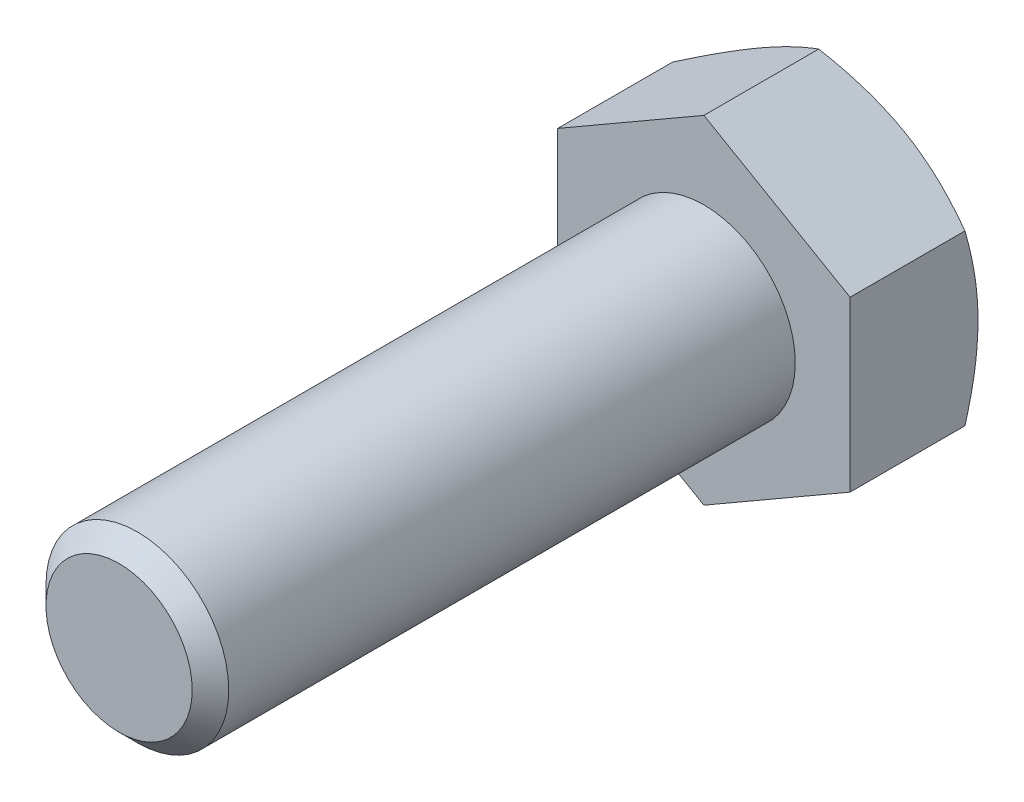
ISO-10303-21;
HEADER;
FILE_DESCRIPTION(('STEP AP214'),'2;1');
FILE_NAME('part.step','',(''),(''),'','','');
FILE_SCHEMA(('AUTOMOTIVE_DESIGN { 1 0 10303 214 1 1 1 1 }'));
ENDSEC;
DATA;
#1=APPLICATION_CONTEXT('core data for automotive mechanical design processes');
#2=APPLICATION_PROTOCOL_DEFINITION('international standard','automotive_design',2000,#1);
#3=PRODUCT_CONTEXT('',#1,'mechanical');
#4=PRODUCT('Part','Part','',(#3));
#5=PRODUCT_RELATED_PRODUCT_CATEGORY('part','',(#4));
#6=PRODUCT_DEFINITION_FORMATION('','',#4);
#7=PRODUCT_DEFINITION_CONTEXT('part definition',#1,'design');
#8=PRODUCT_DEFINITION('design','',#6,#7);
#9=PRODUCT_DEFINITION_SHAPE('','',#8);
#10=(LENGTH_UNIT() NAMED_UNIT(*) SI_UNIT(.MILLI.,.METRE.));
#11=(NAMED_UNIT(*) PLANE_ANGLE_UNIT() SI_UNIT($,.RADIAN.));
#12=(NAMED_UNIT(*) SI_UNIT($,.STERADIAN.) SOLID_ANGLE_UNIT());
#13=UNCERTAINTY_MEASURE_WITH_UNIT(LENGTH_MEASURE(1.E-05),#10,'distance_accuracy_value','');
#14=(GEOMETRIC_REPRESENTATION_CONTEXT(3) GLOBAL_UNCERTAINTY_ASSIGNED_CONTEXT((#13)) GLOBAL_UNIT_ASSIGNED_CONTEXT((#10,
#11,#12)) REPRESENTATION_CONTEXT('',''));
#15=CARTESIAN_POINT('',(0.,0.,0.));
#16=DIRECTION('',(0.,0.,1.));
#17=DIRECTION('',(1.,0.,0.));
#18=AXIS2_PLACEMENT_3D('',#15,#16,#17);
#19=CARTESIAN_POINT('',(0.,0.,16.));
#20=DIRECTION('',(0.,0.,1.));
#21=DIRECTION('',(1.,0.,0.));
#22=AXIS2_PLACEMENT_3D('',#19,#20,#21);
#23=PLANE('',#22);
#24=CARTESIAN_POINT('',(0.,0.,16.));
#25=DIRECTION('',(0.,0.,1.));
#26=DIRECTION('',(1.,0.,0.));
#27=AXIS2_PLACEMENT_3D('',#24,#25,#26);
#28=CIRCLE('',#27,2.);
#29=CARTESIAN_POINT('',(2.,0.,16.));
#30=VERTEX_POINT('',#29);
#31=EDGE_CURVE('E205',#30,#30,#28,.T.);
#32=ORIENTED_EDGE('',*,*,#31,.T.);
#33=EDGE_LOOP('',(#32));
#34=FACE_BOUND('',#33,.T.);
#35=ADVANCED_FACE('F31',(#34),#23,.T.);
#36=CARTESIAN_POINT('',(0.,0.,0.));
#37=DIRECTION('',(0.,0.,1.));
#38=DIRECTION('',(1.,0.,0.));
#39=AXIS2_PLACEMENT_3D('',#36,#37,#38);
#40=CYLINDRICAL_SURFACE('',#39,2.5);
#41=CARTESIAN_POINT('',(0.,0.,15.5));
#42=DIRECTION('',(0.,0.,1.));
#43=DIRECTION('',(1.,0.,0.));
#44=AXIS2_PLACEMENT_3D('',#41,#42,#43);
#45=CIRCLE('',#44,2.5);
#46=CARTESIAN_POINT('',(2.5,0.,15.5));
#47=VERTEX_POINT('',#46);
#48=EDGE_CURVE('E207',#47,#47,#45,.F.);
#49=ORIENTED_EDGE('',*,*,#48,.T.);
#50=EDGE_LOOP('',(#49));
#51=FACE_BOUND('',#50,.T.);
#52=CARTESIAN_POINT('',(0.,0.,0.));
#53=DIRECTION('',(0.,0.,1.));
#54=DIRECTION('',(1.,0.,0.));
#55=AXIS2_PLACEMENT_3D('',#52,#53,#54);
#56=CIRCLE('',#55,2.5);
#57=CARTESIAN_POINT('',(2.5,0.,0.));
#58=VERTEX_POINT('',#57);
#59=EDGE_CURVE('E208',#58,#58,#56,.F.);
#60=ORIENTED_EDGE('',*,*,#59,.F.);
#61=EDGE_LOOP('',(#60));
#62=FACE_BOUND('',#61,.T.);
#63=ADVANCED_FACE('F196',(#51,#62),#40,.T.);
#64=CARTESIAN_POINT('',(0.,0.,16.));
#65=DIRECTION('',(0.,0.,-1.));
#66=DIRECTION('',(-1.,0.,0.));
#67=AXIS2_PLACEMENT_3D('',#64,#65,#66);
#68=CONICAL_SURFACE('',#67,2.,0.785398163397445);
#69=ORIENTED_EDGE('',*,*,#48,.F.);
#70=EDGE_LOOP('',(#69));
#71=FACE_BOUND('',#70,.T.);
#72=ORIENTED_EDGE('',*,*,#31,.F.);
#73=EDGE_LOOP('',(#72));
#74=FACE_BOUND('',#73,.T.);
#75=ADVANCED_FACE('F201',(#71,#74),#68,.T.);
#76=CARTESIAN_POINT('',(0.,4.61880215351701,-3.5));
#77=DIRECTION('',(0.499999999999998,0.86602540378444,0.));
#78=DIRECTION('',(-0.86602540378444,0.499999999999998,0.));
#79=AXIS2_PLACEMENT_3D('',#76,#77,#78);
#80=PLANE('',#79);
#81=CARTESIAN_POINT('',(-0.000200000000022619,4.61891762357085,-3.14266774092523));
#82=CARTESIAN_POINT('',(0.175579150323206,4.51743148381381,-3.20128212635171));
#83=CARTESIAN_POINT('',(0.352875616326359,4.41506932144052,-3.25458967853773));
#84=CARTESIAN_POINT('',(0.710538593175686,4.2085725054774,-3.34763832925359));
#85=CARTESIAN_POINT('',(0.890911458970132,4.10443418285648,-3.38734651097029));
#86=CARTESIAN_POINT('',(1.24942181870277,3.89744813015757,-3.44915778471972));
#87=CARTESIAN_POINT('',(1.42750415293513,3.7946322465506,-3.47167226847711));
#88=CARTESIAN_POINT('',(1.78450671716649,3.58851671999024,-3.49854937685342));
#89=CARTESIAN_POINT('',(1.96342564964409,3.48521782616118,-3.50293425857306));
#90=CARTESIAN_POINT('',(2.29774284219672,3.2921997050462,-3.49380992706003));
#91=CARTESIAN_POINT('',(2.45319115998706,3.20245157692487,-3.48254104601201));
#92=CARTESIAN_POINT('',(2.76307505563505,3.02354002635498,-3.44682600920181));
#93=CARTESIAN_POINT('',(2.91750956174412,2.93437722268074,-3.42236765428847));
#94=CARTESIAN_POINT('',(3.22803232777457,2.75509682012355,-3.36122393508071));
#95=CARTESIAN_POINT('',(3.3840812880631,2.66500191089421,-3.32427939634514));
#96=CARTESIAN_POINT('',(3.69385183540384,2.48615580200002,-3.24042992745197));
#97=CARTESIAN_POINT('',(3.84757739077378,2.39740231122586,-3.19354469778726));
#98=CARTESIAN_POINT('',(4.0002,2.30928560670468,-3.14266774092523));
#99=B_SPLINE_CURVE_WITH_KNOTS('',3,(#81,#82,#83,#84,#85,#86,#87,#88,#89,#90,#91,#92,#93,#94,#95,
#96,#97,#98),.UNSPECIFIED.,.F.,.F.,(4,2,2,2,2,2,2,2,4),(0.,0.634047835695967,1.26961969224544,
1.88946157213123,2.50854226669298,3.04757825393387,3.58711366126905,4.13861653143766,
4.68903648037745),.UNSPECIFIED.);
#100=CARTESIAN_POINT('',(0.,4.61880215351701,-3.14273441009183));
#101=VERTEX_POINT('',#100);
#102=CARTESIAN_POINT('',(1.99999999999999,3.46410161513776,-3.5));
#103=VERTEX_POINT('',#102);
#104=EDGE_CURVE('E241',#101,#103,#99,.T.);
#105=ORIENTED_EDGE('',*,*,#104,.F.);
#106=DIRECTION('',(0.,0.,1.));
#107=VECTOR('',#106,1.);
#108=CARTESIAN_POINT('',(0.,4.61880215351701,-3.5));
#109=LINE('',#108,#107);
#110=CARTESIAN_POINT('',(0.,4.61880215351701,0.));
#111=VERTEX_POINT('',#110);
#112=EDGE_CURVE('E215',#101,#111,#109,.T.);
#113=ORIENTED_EDGE('',*,*,#112,.T.);
#114=DIRECTION('',(-0.86602540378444,0.499999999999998,0.));
#115=VECTOR('',#114,1.);
#116=CARTESIAN_POINT('',(0.,4.61880215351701,0.));
#117=LINE('',#116,#115);
#118=CARTESIAN_POINT('',(4.,2.30940107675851,0.));
#119=VERTEX_POINT('',#118);
#120=EDGE_CURVE('E239',#119,#111,#117,.T.);
#121=ORIENTED_EDGE('',*,*,#120,.F.);
#122=DIRECTION('',(0.,0.,1.));
#123=VECTOR('',#122,1.);
#124=CARTESIAN_POINT('',(4.,2.30940107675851,-3.5));
#125=LINE('',#124,#123);
#126=CARTESIAN_POINT('',(4.,2.30940107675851,-3.14273441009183));
#127=VERTEX_POINT('',#126);
#128=EDGE_CURVE('E212',#127,#119,#125,.T.);
#129=ORIENTED_EDGE('',*,*,#128,.F.);
#130=EDGE_CURVE('E171',#103,#127,#99,.T.);
#131=ORIENTED_EDGE('',*,*,#130,.F.);
#132=EDGE_LOOP('',(#105,#113,#121,#129,#131));
#133=FACE_BOUND('',#132,.T.);
#134=ADVANCED_FACE('F181',(#133),#80,.T.);
#135=CARTESIAN_POINT('',(4.,-2.30940107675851,-3.5));
#136=DIRECTION('',(1.,0.,0.));
#137=DIRECTION('',(0.,0.,-1.));
#138=AXIS2_PLACEMENT_3D('',#135,#136,#137);
#139=PLANE('',#138);
#140=CARTESIAN_POINT('',(4.,-6.32016209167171,-1.49105074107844));
#141=CARTESIAN_POINT('',(4.,-6.14442149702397,-1.57676392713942));
#142=CARTESIAN_POINT('',(4.,-5.96828976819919,-1.66168830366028));
#143=CARTESIAN_POINT('',(4.,-5.61503642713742,-1.82951794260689));
#144=CARTESIAN_POINT('',(4.,-5.43791467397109,-1.91242290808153));
#145=CARTESIAN_POINT('',(4.,-5.08161610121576,-2.07616457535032));
#146=CARTESIAN_POINT('',(4.,-4.90243340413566,-2.15698853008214));
#147=CARTESIAN_POINT('',(4.,-4.54268290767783,-2.31548071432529));
#148=CARTESIAN_POINT('',(4.,-4.36211517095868,-2.3931490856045));
#149=CARTESIAN_POINT('',(4.,-3.99309046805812,-2.54709429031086));
#150=CARTESIAN_POINT('',(4.,-3.80457523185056,-2.62323217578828));
#151=CARTESIAN_POINT('',(4.,-3.42538286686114,-2.77002330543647));
#152=CARTESIAN_POINT('',(4.,-3.23470550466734,-2.84067595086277));
#153=CARTESIAN_POINT('',(4.,-2.85120603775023,-2.9747272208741));
#154=CARTESIAN_POINT('',(4.,-2.65838877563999,-3.03813956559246));
#155=CARTESIAN_POINT('',(4.,-2.26999073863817,-3.15575322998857));
#156=CARTESIAN_POINT('',(4.,-2.07441081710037,-3.2099573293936));
#157=CARTESIAN_POINT('',(4.,-1.6814638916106,-3.30634238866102));
#158=CARTESIAN_POINT('',(4.,-1.48411388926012,-3.34859141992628));
#159=CARTESIAN_POINT('',(4.,-1.08684206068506,-3.41875684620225));
#160=CARTESIAN_POINT('',(4.,-0.886920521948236,-3.44667482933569));
#161=CARTESIAN_POINT('',(4.,-0.488161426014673,-3.48559194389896));
#162=CARTESIAN_POINT('',(4.,-0.289346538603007,-3.49681761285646));
#163=CARTESIAN_POINT('',(4.,0.108530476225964,-3.5020027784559));
#164=CARTESIAN_POINT('',(4.,0.307592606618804,-3.49596206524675));
#165=CARTESIAN_POINT('',(4.,0.642130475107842,-3.47173841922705));
#166=CARTESIAN_POINT('',(4.,0.777947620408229,-3.45796321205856));
#167=CARTESIAN_POINT('',(4.,1.04865722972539,-3.42317125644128));
#168=CARTESIAN_POINT('',(4.,1.18354957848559,-3.4021536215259));
#169=CARTESIAN_POINT('',(4.,1.58661718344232,-3.32933470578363));
#170=CARTESIAN_POINT('',(4.,1.85305348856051,-3.2677780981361));
#171=CARTESIAN_POINT('',(4.,2.2516931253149,-3.16013293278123));
#172=CARTESIAN_POINT('',(4.,2.38593642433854,-3.12116080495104));
#173=CARTESIAN_POINT('',(4.,2.65312122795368,-3.03894486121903));
#174=CARTESIAN_POINT('',(4.,2.78606272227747,-2.99570101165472));
#175=CARTESIAN_POINT('',(4.,3.05068341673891,-2.90565399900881));
#176=CARTESIAN_POINT('',(4.,3.18236294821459,-2.8588518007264));
#177=CARTESIAN_POINT('',(4.,3.44461473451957,-2.76226098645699));
#178=CARTESIAN_POINT('',(4.,3.57518701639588,-2.71247244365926));
#179=CARTESIAN_POINT('',(4.,3.93177798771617,-2.57257226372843));
#180=CARTESIAN_POINT('',(4.,4.15680215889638,-2.47992787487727));
#181=CARTESIAN_POINT('',(4.,4.60447894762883,-2.28905562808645));
#182=CARTESIAN_POINT('',(4.,4.82713127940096,-2.19082710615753));
#183=CARTESIAN_POINT('',(4.,5.27061186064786,-1.99013448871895));
#184=CARTESIAN_POINT('',(4.,5.49143940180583,-1.88766883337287));
#185=CARTESIAN_POINT('',(4.,5.93157734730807,-1.67952247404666));
#186=CARTESIAN_POINT('',(4.,6.15088770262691,-1.57384166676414));
#187=CARTESIAN_POINT('',(4.,6.58864452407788,-1.35980684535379));
#188=CARTESIAN_POINT('',(4.,6.80708897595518,-1.25144872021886));
#189=CARTESIAN_POINT('',(4.,7.24298360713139,-1.0327486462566));
#190=CARTESIAN_POINT('',(4.,7.4604337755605,-0.922406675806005));
#191=CARTESIAN_POINT('',(4.,8.11147090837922,-0.589073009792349));
#192=CARTESIAN_POINT('',(4.,8.54384921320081,-0.363721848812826));
#193=CARTESIAN_POINT('',(4.,9.35956992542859,0.0664624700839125));
#194=CARTESIAN_POINT('',(4.,9.74313951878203,0.270866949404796));
#195=CARTESIAN_POINT('',(4.,10.5090013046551,0.682114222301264));
#196=CARTESIAN_POINT('',(4.,10.891293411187,0.888957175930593));
#197=CARTESIAN_POINT('',(4.,11.6535663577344,1.30371780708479));
#198=CARTESIAN_POINT('',(4.,12.0335506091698,1.51162922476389));
#199=CARTESIAN_POINT('',(4.,12.7927224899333,1.928827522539));
#200=CARTESIAN_POINT('',(4.,13.1719101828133,2.13811428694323));
#201=CARTESIAN_POINT('',(4.,13.5508195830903,2.34790058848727));
#202=B_SPLINE_CURVE_WITH_KNOTS('',3,(#140,#141,#142,#143,#144,#145,#146,#147,#148,#149,#150,
#151,#152,#153,#154,#155,#156,#157,#158,#159,#160,#161,#162,#163,#164,#165,#166,#167,#168,#169,
#170,#171,#172,#173,#174,#175,#176,#177,#178,#179,#180,#181,#182,#183,#184,#185,#186,#187,#188,
#189,#190,#191,#192,#193,#194,#195,#196,#197,#198,#199,#200,#201),.UNSPECIFIED.,.F.,.F.,(4,2,2,
2,2,2,2,2,2,2,2,2,2,2,2,2,2,2,2,2,2,2,2,2,2,2,2,2,2,2,4),(0.,0.586592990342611,1.17327172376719,
1.76295108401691,2.35260392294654,2.96246799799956,3.57239854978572,4.18115341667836,
4.78972418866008,5.39475667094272,5.99972209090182,6.59639988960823,7.19308494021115,
7.60243041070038,8.01182600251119,8.83100524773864,9.25032401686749,9.66964609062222,
10.0888548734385,10.5080533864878,11.2379871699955,11.9680079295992,12.6982998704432,
13.4286153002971,14.1601319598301,14.8916565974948,16.354355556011,17.6582490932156,
18.9622286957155,20.261662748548,21.5609888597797),.UNSPECIFIED.);
#203=CARTESIAN_POINT('',(4.,0.,-3.5));
#204=VERTEX_POINT('',#203);
#205=EDGE_CURVE('E169',#127,#204,#202,.F.);
#206=ORIENTED_EDGE('',*,*,#205,.F.);
#207=ORIENTED_EDGE('',*,*,#128,.T.);
#208=DIRECTION('',(0.,1.,0.));
#209=VECTOR('',#208,1.);
#210=CARTESIAN_POINT('',(4.,-2.30940107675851,0.));
#211=LINE('',#210,#209);
#212=CARTESIAN_POINT('',(4.,-2.30940107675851,0.));
#213=VERTEX_POINT('',#212);
#214=EDGE_CURVE('E217',#213,#119,#211,.T.);
#215=ORIENTED_EDGE('',*,*,#214,.F.);
#216=DIRECTION('',(0.,0.,1.));
#217=VECTOR('',#216,1.);
#218=CARTESIAN_POINT('',(4.,-2.30940107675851,-3.5));
#219=LINE('',#218,#217);
#220=CARTESIAN_POINT('',(4.,-2.30940107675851,-3.14273441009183));
#221=VERTEX_POINT('',#220);
#222=EDGE_CURVE('E223',#221,#213,#219,.T.);
#223=ORIENTED_EDGE('',*,*,#222,.F.);
#224=EDGE_CURVE('E164',#204,#221,#202,.F.);
#225=ORIENTED_EDGE('',*,*,#224,.F.);
#226=EDGE_LOOP('',(#206,#207,#215,#223,#225));
#227=FACE_BOUND('',#226,.T.);
#228=ADVANCED_FACE('F177',(#227),#139,.T.);
#229=CARTESIAN_POINT('',(0.,-4.61880215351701,-3.5));
#230=DIRECTION('',(0.499999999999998,-0.86602540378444,0.));
#231=DIRECTION('',(0.86602540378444,0.499999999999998,0.));
#232=AXIS2_PLACEMENT_3D('',#229,#230,#231);
#233=PLANE('',#232);
#234=CARTESIAN_POINT('',(4.0002,-2.30928560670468,-3.14266774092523));
#235=CARTESIAN_POINT('',(3.82442084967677,-2.41077174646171,-3.20128212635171));
#236=CARTESIAN_POINT('',(3.64712438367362,-2.513133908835,-3.25458967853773));
#237=CARTESIAN_POINT('',(3.28946140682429,-2.71963072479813,-3.3476383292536));
#238=CARTESIAN_POINT('',(3.10908854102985,-2.82376904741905,-3.3873465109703));
#239=CARTESIAN_POINT('',(2.75057818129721,-3.03075510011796,-3.44915778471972));
#240=CARTESIAN_POINT('',(2.57249584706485,-3.13357098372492,-3.47167226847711));
#241=CARTESIAN_POINT('',(2.21549328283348,-3.33968651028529,-3.49854937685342));
#242=CARTESIAN_POINT('',(2.03657435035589,-3.44298540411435,-3.50293425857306));
#243=CARTESIAN_POINT('',(1.70225715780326,-3.63600352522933,-3.49380992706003));
#244=CARTESIAN_POINT('',(1.54680884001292,-3.72575165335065,-3.48254104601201));
#245=CARTESIAN_POINT('',(1.23692494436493,-3.90466320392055,-3.44682600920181));
#246=CARTESIAN_POINT('',(1.08249043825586,-3.99382600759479,-3.42236765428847));
#247=CARTESIAN_POINT('',(0.771967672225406,-4.17310641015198,-3.36122393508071));
#248=CARTESIAN_POINT('',(0.61591871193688,-4.26320131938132,-3.32427939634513));
#249=CARTESIAN_POINT('',(0.306148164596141,-4.44204742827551,-3.24042992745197));
#250=CARTESIAN_POINT('',(0.1524226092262,-4.53080091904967,-3.19354469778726));
#251=CARTESIAN_POINT('',(-0.000200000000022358,-4.61891762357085,-3.14266774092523));
#252=B_SPLINE_CURVE_WITH_KNOTS('',3,(#234,#235,#236,#237,#238,#239,#240,#241,#242,#243,#244,
#245,#246,#247,#248,#249,#250,#251),.UNSPECIFIED.,.F.,.F.,(4,2,2,2,2,2,2,2,4),(0.,
0.634047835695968,1.26961969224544,1.88946157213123,2.50854226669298,3.04757825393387,
3.58711366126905,4.13861653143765,4.68903648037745),.UNSPECIFIED.);
#253=CARTESIAN_POINT('',(1.99999999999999,-3.46410161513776,-3.5));
#254=VERTEX_POINT('',#253);
#255=EDGE_CURVE('E170',#221,#254,#252,.T.);
#256=ORIENTED_EDGE('',*,*,#255,.F.);
#257=ORIENTED_EDGE('',*,*,#222,.T.);
#258=DIRECTION('',(0.86602540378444,0.499999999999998,0.));
#259=VECTOR('',#258,1.);
#260=CARTESIAN_POINT('',(0.,-4.61880215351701,0.));
#261=LINE('',#260,#259);
#262=CARTESIAN_POINT('',(0.,-4.61880215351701,0.));
#263=VERTEX_POINT('',#262);
#264=EDGE_CURVE('E228',#263,#213,#261,.T.);
#265=ORIENTED_EDGE('',*,*,#264,.F.);
#266=DIRECTION('',(0.,0.,1.));
#267=VECTOR('',#266,1.);
#268=CARTESIAN_POINT('',(0.,-4.61880215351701,-3.5));
#269=LINE('',#268,#267);
#270=CARTESIAN_POINT('',(0.,-4.61880215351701,-3.14273441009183));
#271=VERTEX_POINT('',#270);
#272=EDGE_CURVE('E221',#271,#263,#269,.T.);
#273=ORIENTED_EDGE('',*,*,#272,.F.);
#274=EDGE_CURVE('E158',#254,#271,#252,.T.);
#275=ORIENTED_EDGE('',*,*,#274,.F.);
#276=EDGE_LOOP('',(#256,#257,#265,#273,#275));
#277=FACE_BOUND('',#276,.T.);
#278=ADVANCED_FACE('F180',(#277),#233,.T.);
#279=CARTESIAN_POINT('',(0.,-4.61880215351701,-3.5));
#280=DIRECTION('',(-0.500000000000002,-0.866025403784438,0.));
#281=DIRECTION('',(0.866025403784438,-0.500000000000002,0.));
#282=AXIS2_PLACEMENT_3D('',#279,#280,#281);
#283=PLANE('',#282);
#284=CARTESIAN_POINT('',(0.000199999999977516,-4.61891762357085,-3.14266774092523));
#285=CARTESIAN_POINT('',(-0.17557915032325,-4.51743148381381,-3.20128212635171));
#286=CARTESIAN_POINT('',(-0.352875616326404,-4.41506932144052,-3.25458967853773));
#287=CARTESIAN_POINT('',(-0.710538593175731,-4.2085725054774,-3.34763832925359));
#288=CARTESIAN_POINT('',(-0.890911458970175,-4.10443418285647,-3.38734651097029));
#289=CARTESIAN_POINT('',(-1.24942181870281,-3.89744813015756,-3.44915778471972));
#290=CARTESIAN_POINT('',(-1.42750415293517,-3.7946322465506,-3.47167226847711));
#291=CARTESIAN_POINT('',(-1.78450671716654,-3.58851671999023,-3.49854937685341));
#292=CARTESIAN_POINT('',(-1.96342564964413,-3.48521782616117,-3.50293425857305));
#293=CARTESIAN_POINT('',(-2.29774284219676,-3.29219970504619,-3.49380992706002));
#294=CARTESIAN_POINT('',(-2.45319115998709,-3.20245157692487,-3.482541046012));
#295=CARTESIAN_POINT('',(-2.76307505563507,-3.02354002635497,-3.4468260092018));
#296=CARTESIAN_POINT('',(-2.91750956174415,-2.93437722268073,-3.42236765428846));
#297=CARTESIAN_POINT('',(-3.22803232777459,-2.75509682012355,-3.3612239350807));
#298=CARTESIAN_POINT('',(-3.38408128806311,-2.66500191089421,-3.32427939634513));
#299=CARTESIAN_POINT('',(-3.69385183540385,-2.48615580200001,-3.24042992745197));
#300=CARTESIAN_POINT('',(-3.84757739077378,-2.39740231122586,-3.19354469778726));
#301=CARTESIAN_POINT('',(-4.0002,-2.30928560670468,-3.14266774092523));
#302=B_SPLINE_CURVE_WITH_KNOTS('',3,(#284,#285,#286,#287,#288,#289,#290,#291,#292,#293,#294,
#295,#296,#297,#298,#299,#300,#301),.UNSPECIFIED.,.F.,.F.,(4,2,2,2,2,2,2,2,4),(0.,
0.634047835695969,1.26961969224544,1.88946157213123,2.50854226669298,3.04757825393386,
3.58711366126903,4.13861653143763,4.68903648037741),.UNSPECIFIED.);
#303=CARTESIAN_POINT('',(-2.00000000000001,-3.46410161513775,-3.5));
#304=VERTEX_POINT('',#303);
#305=EDGE_CURVE('E260',#271,#304,#302,.T.);
#306=ORIENTED_EDGE('',*,*,#305,.F.);
#307=ORIENTED_EDGE('',*,*,#272,.T.);
#308=DIRECTION('',(0.866025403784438,-0.500000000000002,0.));
#309=VECTOR('',#308,1.);
#310=CARTESIAN_POINT('',(0.,-4.61880215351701,0.));
#311=LINE('',#310,#309);
#312=CARTESIAN_POINT('',(-4.,-2.30940107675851,0.));
#313=VERTEX_POINT('',#312);
#314=EDGE_CURVE('E231',#313,#263,#311,.T.);
#315=ORIENTED_EDGE('',*,*,#314,.F.);
#316=DIRECTION('',(0.,0.,1.));
#317=VECTOR('',#316,1.);
#318=CARTESIAN_POINT('',(-4.,-2.30940107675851,-3.5));
#319=LINE('',#318,#317);
#320=CARTESIAN_POINT('',(-4.,-2.30940107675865,-3.14273441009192));
#321=VERTEX_POINT('',#320);
#322=EDGE_CURVE('E219',#321,#313,#319,.T.);
#323=ORIENTED_EDGE('',*,*,#322,.F.);
#324=EDGE_CURVE('E107',#304,#321,#302,.T.);
#325=ORIENTED_EDGE('',*,*,#324,.F.);
#326=EDGE_LOOP('',(#306,#307,#315,#323,#325));
#327=FACE_BOUND('',#326,.T.);
#328=ADVANCED_FACE('F185',(#327),#283,.T.);
#329=CARTESIAN_POINT('',(-4.,-2.30940107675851,-3.5));
#330=DIRECTION('',(-1.,0.,0.));
#331=DIRECTION('',(0.,0.,1.));
#332=AXIS2_PLACEMENT_3D('',#329,#330,#331);
#333=PLANE('',#332);
#334=CARTESIAN_POINT('',(-4.,-6.3201620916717,-1.49105074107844));
#335=CARTESIAN_POINT('',(-4.,-6.14442149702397,-1.57676392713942));
#336=CARTESIAN_POINT('',(-4.,-5.96828976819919,-1.66168830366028));
#337=CARTESIAN_POINT('',(-4.,-5.61503642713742,-1.82951794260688));
#338=CARTESIAN_POINT('',(-4.,-5.43791467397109,-1.91242290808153));
#339=CARTESIAN_POINT('',(-4.,-5.08161610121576,-2.07616457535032));
#340=CARTESIAN_POINT('',(-4.,-4.90243340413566,-2.15698853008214));
#341=CARTESIAN_POINT('',(-4.,-4.54268290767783,-2.31548071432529));
#342=CARTESIAN_POINT('',(-4.,-4.36211517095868,-2.39314908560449));
#343=CARTESIAN_POINT('',(-4.,-3.99309046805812,-2.54709429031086));
#344=CARTESIAN_POINT('',(-4.,-3.80457523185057,-2.62323217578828));
#345=CARTESIAN_POINT('',(-4.,-3.42538286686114,-2.77002330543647));
#346=CARTESIAN_POINT('',(-4.,-3.23470550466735,-2.84067595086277));
#347=CARTESIAN_POINT('',(-4.,-2.85120603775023,-2.9747272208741));
#348=CARTESIAN_POINT('',(-4.,-2.65838877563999,-3.03813956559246));
#349=CARTESIAN_POINT('',(-4.,-2.26999073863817,-3.15575322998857));
#350=CARTESIAN_POINT('',(-4.,-2.07441081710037,-3.2099573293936));
#351=CARTESIAN_POINT('',(-4.,-1.6814638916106,-3.30634238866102));
#352=CARTESIAN_POINT('',(-4.,-1.48411388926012,-3.34859141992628));
#353=CARTESIAN_POINT('',(-4.,-1.08684206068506,-3.41875684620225));
#354=CARTESIAN_POINT('',(-4.,-0.886920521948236,-3.44667482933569));
#355=CARTESIAN_POINT('',(-4.,-0.488161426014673,-3.48559194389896));
#356=CARTESIAN_POINT('',(-4.,-0.289346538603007,-3.49681761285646));
#357=CARTESIAN_POINT('',(-4.,0.108530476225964,-3.5020027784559));
#358=CARTESIAN_POINT('',(-4.,0.307592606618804,-3.49596206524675));
#359=CARTESIAN_POINT('',(-4.,0.642130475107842,-3.47173841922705));
#360=CARTESIAN_POINT('',(-4.,0.777947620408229,-3.45796321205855));
#361=CARTESIAN_POINT('',(-4.,1.04865722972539,-3.42317125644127));
#362=CARTESIAN_POINT('',(-4.,1.18354957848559,-3.4021536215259));
#363=CARTESIAN_POINT('',(-4.,1.58661718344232,-3.32933470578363));
#364=CARTESIAN_POINT('',(-4.,1.8530534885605,-3.2677780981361));
#365=CARTESIAN_POINT('',(-4.,2.2516931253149,-3.16013293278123));
#366=CARTESIAN_POINT('',(-4.,2.38593642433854,-3.12116080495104));
#367=CARTESIAN_POINT('',(-4.,2.65312122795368,-3.03894486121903));
#368=CARTESIAN_POINT('',(-4.,2.78606272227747,-2.99570101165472));
#369=CARTESIAN_POINT('',(-4.,3.05068341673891,-2.90565399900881));
#370=CARTESIAN_POINT('',(-4.,3.18236294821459,-2.8588518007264));
#371=CARTESIAN_POINT('',(-4.,3.44461473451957,-2.76226098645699));
#372=CARTESIAN_POINT('',(-4.,3.57518701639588,-2.71247244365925));
#373=CARTESIAN_POINT('',(-4.,3.93177798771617,-2.57257226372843));
#374=CARTESIAN_POINT('',(-4.,4.15680215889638,-2.47992787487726));
#375=CARTESIAN_POINT('',(-4.,4.60447894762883,-2.28905562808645));
#376=CARTESIAN_POINT('',(-4.,4.82713127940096,-2.19082710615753));
#377=CARTESIAN_POINT('',(-4.,5.27061186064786,-1.99013448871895));
#378=CARTESIAN_POINT('',(-4.,5.49143940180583,-1.88766883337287));
#379=CARTESIAN_POINT('',(-4.,5.93157734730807,-1.67952247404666));
#380=CARTESIAN_POINT('',(-4.,6.15088770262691,-1.57384166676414));
#381=CARTESIAN_POINT('',(-4.,6.58864452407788,-1.35980684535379));
#382=CARTESIAN_POINT('',(-4.,6.80708897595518,-1.25144872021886));
#383=CARTESIAN_POINT('',(-4.,7.24298360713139,-1.0327486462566));
#384=CARTESIAN_POINT('',(-4.,7.4604337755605,-0.922406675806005));
#385=CARTESIAN_POINT('',(-4.,8.11147090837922,-0.589073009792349));
#386=CARTESIAN_POINT('',(-4.,8.5438492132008,-0.363721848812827));
#387=CARTESIAN_POINT('',(-4.,9.35956992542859,0.066462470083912));
#388=CARTESIAN_POINT('',(-4.,9.74313951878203,0.270866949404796));
#389=CARTESIAN_POINT('',(-4.,10.5090013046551,0.682114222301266));
#390=CARTESIAN_POINT('',(-4.,10.891293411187,0.888957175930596));
#391=CARTESIAN_POINT('',(-4.,11.6535663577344,1.30371780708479));
#392=CARTESIAN_POINT('',(-4.,12.0335506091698,1.51162922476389));
#393=CARTESIAN_POINT('',(-4.,12.7927224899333,1.92882752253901));
#394=CARTESIAN_POINT('',(-4.,13.1719101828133,2.13811428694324));
#395=CARTESIAN_POINT('',(-4.,13.5508195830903,2.34790058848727));
#396=B_SPLINE_CURVE_WITH_KNOTS('',3,(#334,#335,#336,#337,#338,#339,#340,#341,#342,#343,#344,
#345,#346,#347,#348,#349,#350,#351,#352,#353,#354,#355,#356,#357,#358,#359,#360,#361,#362,#363,
#364,#365,#366,#367,#368,#369,#370,#371,#372,#373,#374,#375,#376,#377,#378,#379,#380,#381,#382,
#383,#384,#385,#386,#387,#388,#389,#390,#391,#392,#393,#394,#395),.UNSPECIFIED.,.F.,.F.,(4,2,2,
2,2,2,2,2,2,2,2,2,2,2,2,2,2,2,2,2,2,2,2,2,2,2,2,2,2,2,4),(0.,0.58659299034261,1.17327172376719,
1.76295108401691,2.35260392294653,2.96246799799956,3.57239854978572,4.18115341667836,
4.78972418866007,5.39475667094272,5.99972209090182,6.59639988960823,7.19308494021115,
7.60243041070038,8.01182600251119,8.83100524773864,9.25032401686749,9.66964609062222,
10.0888548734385,10.5080533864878,11.2379871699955,11.9680079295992,12.6982998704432,
13.4286153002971,14.1601319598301,14.8916565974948,16.354355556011,17.6582490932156,
18.9622286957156,20.261662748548,21.5609888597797),.UNSPECIFIED.);
#397=CARTESIAN_POINT('',(-4.,0.,-3.5));
#398=VERTEX_POINT('',#397);
#399=EDGE_CURVE('E102',#321,#398,#396,.T.);
#400=ORIENTED_EDGE('',*,*,#399,.F.);
#401=ORIENTED_EDGE('',*,*,#322,.T.);
#402=DIRECTION('',(0.,-1.,0.));
#403=VECTOR('',#402,1.);
#404=CARTESIAN_POINT('',(-4.,-2.30940107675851,0.));
#405=LINE('',#404,#403);
#406=CARTESIAN_POINT('',(-4.,2.30940107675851,0.));
#407=VERTEX_POINT('',#406);
#408=EDGE_CURVE('E234',#407,#313,#405,.T.);
#409=ORIENTED_EDGE('',*,*,#408,.F.);
#410=DIRECTION('',(0.,0.,1.));
#411=VECTOR('',#410,1.);
#412=CARTESIAN_POINT('',(-4.,2.30940107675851,-3.5));
#413=LINE('',#412,#411);
#414=CARTESIAN_POINT('',(-4.,2.30940107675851,-3.14273441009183));
#415=VERTEX_POINT('',#414);
#416=EDGE_CURVE('E128',#415,#407,#413,.T.);
#417=ORIENTED_EDGE('',*,*,#416,.F.);
#418=EDGE_CURVE('E111',#398,#415,#396,.T.);
#419=ORIENTED_EDGE('',*,*,#418,.F.);
#420=EDGE_LOOP('',(#400,#401,#409,#417,#419));
#421=FACE_BOUND('',#420,.T.);
#422=ADVANCED_FACE('F126',(#421),#333,.T.);
#423=CARTESIAN_POINT('',(-4.,2.30940107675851,-3.5));
#424=DIRECTION('',(-0.500000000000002,0.866025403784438,0.));
#425=DIRECTION('',(-0.866025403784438,-0.500000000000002,0.));
#426=AXIS2_PLACEMENT_3D('',#423,#424,#425);
#427=PLANE('',#426);
#428=CARTESIAN_POINT('',(-4.0002,2.30928560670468,-3.14266774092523));
#429=CARTESIAN_POINT('',(-3.82442084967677,2.41077174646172,-3.20128212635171));
#430=CARTESIAN_POINT('',(-3.64712438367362,2.51313390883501,-3.25458967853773));
#431=CARTESIAN_POINT('',(-3.28946140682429,2.71963072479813,-3.34763832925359));
#432=CARTESIAN_POINT('',(-3.10908854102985,2.82376904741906,-3.38734651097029));
#433=CARTESIAN_POINT('',(-2.75057818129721,3.03075510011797,-3.44915778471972));
#434=CARTESIAN_POINT('',(-2.57249584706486,3.13357098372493,-3.47167226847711));
#435=CARTESIAN_POINT('',(-2.21549328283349,3.3396865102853,-3.49854937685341));
#436=CARTESIAN_POINT('',(-2.0365743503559,3.44298540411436,-3.50293425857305));
#437=CARTESIAN_POINT('',(-1.70225715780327,3.63600352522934,-3.49380992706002));
#438=CARTESIAN_POINT('',(-1.54680884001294,3.72575165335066,-3.482541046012));
#439=CARTESIAN_POINT('',(-1.23692494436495,3.90466320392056,-3.4468260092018));
#440=CARTESIAN_POINT('',(-1.08249043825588,3.9938260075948,-3.42236765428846));
#441=CARTESIAN_POINT('',(-0.771967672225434,4.17310641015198,-3.3612239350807));
#442=CARTESIAN_POINT('',(-0.615918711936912,4.26320131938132,-3.32427939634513));
#443=CARTESIAN_POINT('',(-0.30614816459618,4.44204742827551,-3.24042992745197));
#444=CARTESIAN_POINT('',(-0.152422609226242,4.53080091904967,-3.19354469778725));
#445=CARTESIAN_POINT('',(0.000199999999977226,4.61891762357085,-3.14266774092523));
#446=B_SPLINE_CURVE_WITH_KNOTS('',3,(#428,#429,#430,#431,#432,#433,#434,#435,#436,#437,#438,
#439,#440,#441,#442,#443,#444,#445),.UNSPECIFIED.,.F.,.F.,(4,2,2,2,2,2,2,2,4),(0.,
0.634047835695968,1.26961969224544,1.88946157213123,2.50854226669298,3.04757825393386,
3.58711366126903,4.13861653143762,4.68903648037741),.UNSPECIFIED.);
#447=CARTESIAN_POINT('',(-2.00000000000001,3.46410161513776,-3.5));
#448=VERTEX_POINT('',#447);
#449=EDGE_CURVE('E117',#415,#448,#446,.T.);
#450=ORIENTED_EDGE('',*,*,#449,.F.);
#451=ORIENTED_EDGE('',*,*,#416,.T.);
#452=DIRECTION('',(-0.866025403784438,-0.500000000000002,0.));
#453=VECTOR('',#452,1.);
#454=CARTESIAN_POINT('',(-4.,2.30940107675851,0.));
#455=LINE('',#454,#453);
#456=EDGE_CURVE('E237',#111,#407,#455,.T.);
#457=ORIENTED_EDGE('',*,*,#456,.F.);
#458=ORIENTED_EDGE('',*,*,#112,.F.);
#459=EDGE_CURVE('E119',#448,#101,#446,.T.);
#460=ORIENTED_EDGE('',*,*,#459,.F.);
#461=EDGE_LOOP('',(#450,#451,#457,#458,#460));
#462=FACE_BOUND('',#461,.T.);
#463=ADVANCED_FACE('F193',(#462),#427,.T.);
#464=CARTESIAN_POINT('',(4.,2.30940107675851,0.));
#465=DIRECTION('',(0.,0.,1.));
#466=DIRECTION('',(1.,0.,0.));
#467=AXIS2_PLACEMENT_3D('',#464,#465,#466);
#468=PLANE('',#467);
#469=ORIENTED_EDGE('',*,*,#59,.T.);
#470=EDGE_LOOP('',(#469));
#471=FACE_BOUND('',#470,.T.);
#472=ORIENTED_EDGE('',*,*,#120,.T.);
#473=ORIENTED_EDGE('',*,*,#456,.T.);
#474=ORIENTED_EDGE('',*,*,#408,.T.);
#475=ORIENTED_EDGE('',*,*,#314,.T.);
#476=ORIENTED_EDGE('',*,*,#264,.T.);
#477=ORIENTED_EDGE('',*,*,#214,.T.);
#478=EDGE_LOOP('',(#472,#473,#474,#475,#476,#477));
#479=FACE_BOUND('',#478,.T.);
#480=ADVANCED_FACE('F150',(#471,#479),#468,.T.);
#481=CARTESIAN_POINT('',(0.,0.,0.));
#482=DIRECTION('',(0.,0.,1.));
#483=DIRECTION('',(1.,0.,0.));
#484=AXIS2_PLACEMENT_3D('',#481,#482,#483);
#485=CONICAL_SURFACE('',#484,10.062177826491,1.0471975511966);
#486=ORIENTED_EDGE('',*,*,#130,.T.);
#487=ORIENTED_EDGE('',*,*,#205,.T.);
#488=CARTESIAN_POINT('',(0.,0.,-3.5));
#489=DIRECTION('',(0.,0.,1.));
#490=DIRECTION('',(1.,0.,0.));
#491=AXIS2_PLACEMENT_3D('',#488,#489,#490);
#492=CIRCLE('',#491,4.);
#493=EDGE_CURVE('E34',#103,#204,#492,.F.);
#494=ORIENTED_EDGE('',*,*,#493,.F.);
#495=EDGE_LOOP('',(#486,#487,#494));
#496=FACE_BOUND('',#495,.T.);
#497=ADVANCED_FACE('F250',(#496),#485,.T.);
#498=ORIENTED_EDGE('',*,*,#104,.T.);
#499=EDGE_CURVE('E124',#448,#103,#492,.F.);
#500=ORIENTED_EDGE('',*,*,#499,.F.);
#501=ORIENTED_EDGE('',*,*,#459,.T.);
#502=EDGE_LOOP('',(#498,#500,#501));
#503=FACE_BOUND('',#502,.T.);
#504=ADVANCED_FACE('F149',(#503),#485,.T.);
#505=ORIENTED_EDGE('',*,*,#418,.T.);
#506=ORIENTED_EDGE('',*,*,#449,.T.);
#507=CARTESIAN_POINT('',(0.,0.,-3.5));
#508=DIRECTION('',(0.,0.,-1.));
#509=DIRECTION('',(-1.,0.,0.));
#510=AXIS2_PLACEMENT_3D('',#507,#508,#509);
#511=CIRCLE('',#510,4.);
#512=EDGE_CURVE('E52',#398,#448,#511,.T.);
#513=ORIENTED_EDGE('',*,*,#512,.F.);
#514=EDGE_LOOP('',(#505,#506,#513));
#515=FACE_BOUND('',#514,.T.);
#516=ADVANCED_FACE('F115',(#515),#485,.T.);
#517=ORIENTED_EDGE('',*,*,#324,.T.);
#518=ORIENTED_EDGE('',*,*,#399,.T.);
#519=EDGE_CURVE('E104',#304,#398,#492,.F.);
#520=ORIENTED_EDGE('',*,*,#519,.F.);
#521=EDGE_LOOP('',(#517,#518,#520));
#522=FACE_BOUND('',#521,.T.);
#523=ADVANCED_FACE('F103',(#522),#485,.T.);
#524=ORIENTED_EDGE('',*,*,#274,.T.);
#525=ORIENTED_EDGE('',*,*,#305,.T.);
#526=EDGE_CURVE('E39',#254,#304,#492,.F.);
#527=ORIENTED_EDGE('',*,*,#526,.F.);
#528=EDGE_LOOP('',(#524,#525,#527));
#529=FACE_BOUND('',#528,.T.);
#530=ADVANCED_FACE('F262',(#529),#485,.T.);
#531=ORIENTED_EDGE('',*,*,#224,.T.);
#532=ORIENTED_EDGE('',*,*,#255,.T.);
#533=EDGE_CURVE('E11',#204,#254,#492,.F.);
#534=ORIENTED_EDGE('',*,*,#533,.F.);
#535=EDGE_LOOP('',(#531,#532,#534));
#536=FACE_BOUND('',#535,.T.);
#537=ADVANCED_FACE('F257',(#536),#485,.T.);
#538=CARTESIAN_POINT('',(4.,2.30940107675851,-3.5));
#539=DIRECTION('',(0.,0.,1.));
#540=DIRECTION('',(1.,0.,0.));
#541=AXIS2_PLACEMENT_3D('',#538,#539,#540);
#542=PLANE('',#541);
#543=ORIENTED_EDGE('',*,*,#493,.T.);
#544=ORIENTED_EDGE('',*,*,#533,.T.);
#545=ORIENTED_EDGE('',*,*,#526,.T.);
#546=ORIENTED_EDGE('',*,*,#519,.T.);
#547=ORIENTED_EDGE('',*,*,#512,.T.);
#548=ORIENTED_EDGE('',*,*,#499,.T.);
#549=EDGE_LOOP('',(#543,#544,#545,#546,#547,#548));
#550=FACE_BOUND('',#549,.T.);
#551=ADVANCED_FACE('F122',(#550),#542,.F.);
#552=CLOSED_SHELL('',(#35,#63,#75,#134,#228,#278,#328,#422,#463,#480,#497,#504,#516,#523,#530,
#537,#551));
#553=MANIFOLD_SOLID_BREP('B2',#552);
#554=ADVANCED_BREP_SHAPE_REPRESENTATION('',(#18,#553),#14);
#555=SHAPE_DEFINITION_REPRESENTATION(#9,#554);
ENDSEC;
END-ISO-10303-21;
